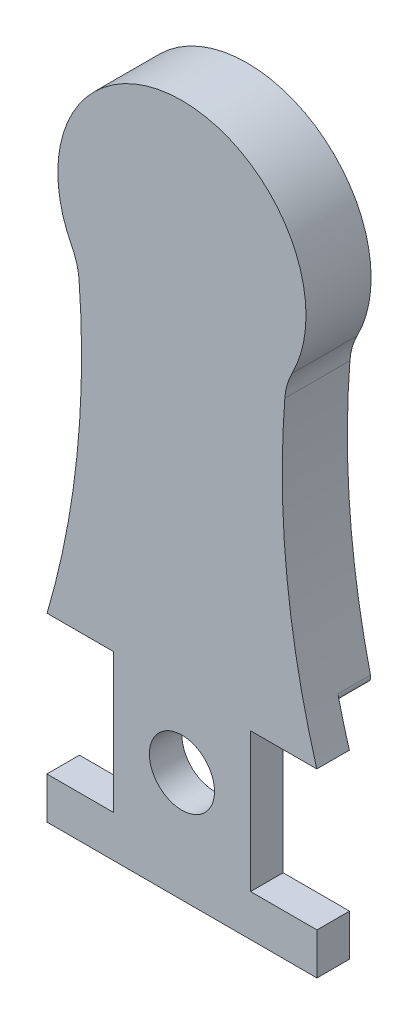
ISO-10303-21;
HEADER;
FILE_DESCRIPTION(('STEP AP214'),'2;1');
FILE_NAME('part.step','',(''),(''),'','','');
FILE_SCHEMA(('AUTOMOTIVE_DESIGN { 1 0 10303 214 1 1 1 1 }'));
ENDSEC;
DATA;
#1=APPLICATION_CONTEXT('core data for automotive mechanical design processes');
#2=APPLICATION_PROTOCOL_DEFINITION('international standard','automotive_design',2000,#1);
#3=PRODUCT_CONTEXT('',#1,'mechanical');
#4=PRODUCT('Part','Part','',(#3));
#5=PRODUCT_RELATED_PRODUCT_CATEGORY('part','',(#4));
#6=PRODUCT_DEFINITION_FORMATION('','',#4);
#7=PRODUCT_DEFINITION_CONTEXT('part definition',#1,'design');
#8=PRODUCT_DEFINITION('design','',#6,#7);
#9=PRODUCT_DEFINITION_SHAPE('','',#8);
#10=(LENGTH_UNIT() NAMED_UNIT(*) SI_UNIT(.MILLI.,.METRE.));
#11=(NAMED_UNIT(*) PLANE_ANGLE_UNIT() SI_UNIT($,.RADIAN.));
#12=(NAMED_UNIT(*) SI_UNIT($,.STERADIAN.) SOLID_ANGLE_UNIT());
#13=UNCERTAINTY_MEASURE_WITH_UNIT(LENGTH_MEASURE(1.E-05),#10,'distance_accuracy_value','');
#14=(GEOMETRIC_REPRESENTATION_CONTEXT(3) GLOBAL_UNCERTAINTY_ASSIGNED_CONTEXT((#13)) GLOBAL_UNIT_ASSIGNED_CONTEXT((#10,
#11,#12)) REPRESENTATION_CONTEXT('',''));
#15=CARTESIAN_POINT('',(0.,0.,0.));
#16=DIRECTION('',(0.,0.,1.));
#17=DIRECTION('',(1.,0.,0.));
#18=AXIS2_PLACEMENT_3D('',#15,#16,#17);
#19=CARTESIAN_POINT('',(0.,0.,0.));
#20=DIRECTION('',(0.,0.,1.));
#21=DIRECTION('',(1.,0.,0.));
#22=AXIS2_PLACEMENT_3D('',#19,#20,#21);
#23=CYLINDRICAL_SURFACE('',#22,5.);
#24=CARTESIAN_POINT('',(0.,0.,10.));
#25=DIRECTION('',(0.,0.,1.));
#26=DIRECTION('',(1.,0.,0.));
#27=AXIS2_PLACEMENT_3D('',#24,#25,#26);
#28=CIRCLE('',#27,5.);
#29=CARTESIAN_POINT('',(5.,0.,10.));
#30=VERTEX_POINT('',#29);
#31=EDGE_CURVE('E195',#30,#30,#28,.T.);
#32=ORIENTED_EDGE('',*,*,#31,.T.);
#33=EDGE_LOOP('',(#32));
#34=FACE_BOUND('',#33,.T.);
#35=CARTESIAN_POINT('',(0.,0.,5.));
#36=DIRECTION('',(0.,0.,-1.));
#37=DIRECTION('',(-1.,0.,0.));
#38=AXIS2_PLACEMENT_3D('',#35,#36,#37);
#39=CIRCLE('',#38,5.);
#40=CARTESIAN_POINT('',(-5.,0.,5.));
#41=VERTEX_POINT('',#40);
#42=EDGE_CURVE('E260',#41,#41,#39,.F.);
#43=ORIENTED_EDGE('',*,*,#42,.F.);
#44=EDGE_LOOP('',(#43));
#45=FACE_BOUND('',#44,.T.);
#46=ADVANCED_FACE('F33',(#34,#45),#23,.F.);
#47=CARTESIAN_POINT('',(-20.9931970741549,10.845815,0.));
#48=DIRECTION('',(0.,1.,0.));
#49=DIRECTION('',(0.,0.,1.));
#50=AXIS2_PLACEMENT_3D('',#47,#48,#49);
#51=PLANE('',#50);
#52=DIRECTION('',(-1.,0.,0.));
#53=VECTOR('',#52,1.);
#54=CARTESIAN_POINT('',(-20.9931970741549,10.845815,5.));
#55=LINE('',#54,#53);
#56=CARTESIAN_POINT('',(-10.542895,10.845815,5.));
#57=VERTEX_POINT('',#56);
#58=CARTESIAN_POINT('',(-20.7164128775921,10.845815,5.));
#59=VERTEX_POINT('',#58);
#60=EDGE_CURVE('E261',#57,#59,#55,.T.);
#61=ORIENTED_EDGE('',*,*,#60,.F.);
#62=DIRECTION('',(0.,0.,1.));
#63=VECTOR('',#62,1.);
#64=CARTESIAN_POINT('',(-10.542895,10.845815,0.));
#65=LINE('',#64,#63);
#66=CARTESIAN_POINT('',(-10.542895,10.845815,10.));
#67=VERTEX_POINT('',#66);
#68=EDGE_CURVE('E192',#57,#67,#65,.T.);
#69=ORIENTED_EDGE('',*,*,#68,.T.);
#70=DIRECTION('',(-1.,0.,0.));
#71=VECTOR('',#70,1.);
#72=CARTESIAN_POINT('',(-20.9931970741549,10.845815,10.));
#73=LINE('',#72,#71);
#74=CARTESIAN_POINT('',(-20.7164128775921,10.845815,10.));
#75=VERTEX_POINT('',#74);
#76=EDGE_CURVE('E184',#67,#75,#73,.T.);
#77=ORIENTED_EDGE('',*,*,#76,.T.);
#78=DIRECTION('',(0.,0.,-1.));
#79=VECTOR('',#78,1.);
#80=CARTESIAN_POINT('',(-20.7164128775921,10.845815,10.));
#81=LINE('',#80,#79);
#82=EDGE_CURVE('E191',#59,#75,#81,.F.);
#83=ORIENTED_EDGE('',*,*,#82,.F.);
#84=EDGE_LOOP('',(#61,#69,#77,#83));
#85=FACE_BOUND('',#84,.T.);
#86=ADVANCED_FACE('F335',(#85),#51,.F.);
#87=CARTESIAN_POINT('',(10.542895,10.845815,0.));
#88=DIRECTION('',(0.,1.,0.));
#89=DIRECTION('',(-1.,0.,0.));
#90=AXIS2_PLACEMENT_3D('',#87,#88,#89);
#91=PLANE('',#90);
#92=DIRECTION('',(-1.,0.,0.));
#93=VECTOR('',#92,1.);
#94=CARTESIAN_POINT('',(10.542895,10.845815,5.));
#95=LINE('',#94,#93);
#96=CARTESIAN_POINT('',(20.7164128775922,10.845815,5.));
#97=VERTEX_POINT('',#96);
#98=CARTESIAN_POINT('',(10.542895,10.845815,5.));
#99=VERTEX_POINT('',#98);
#100=EDGE_CURVE('E162',#97,#99,#95,.T.);
#101=ORIENTED_EDGE('',*,*,#100,.F.);
#102=DIRECTION('',(0.,0.,-1.));
#103=VECTOR('',#102,1.);
#104=CARTESIAN_POINT('',(20.7164128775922,10.845815,10.));
#105=LINE('',#104,#103);
#106=CARTESIAN_POINT('',(20.7164128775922,10.845815,10.));
#107=VERTEX_POINT('',#106);
#108=EDGE_CURVE('E188',#107,#97,#105,.T.);
#109=ORIENTED_EDGE('',*,*,#108,.F.);
#110=DIRECTION('',(-1.,0.,0.));
#111=VECTOR('',#110,1.);
#112=CARTESIAN_POINT('',(10.542895,10.845815,10.));
#113=LINE('',#112,#111);
#114=CARTESIAN_POINT('',(10.542895,10.845815,10.));
#115=VERTEX_POINT('',#114);
#116=EDGE_CURVE('E274',#107,#115,#113,.T.);
#117=ORIENTED_EDGE('',*,*,#116,.T.);
#118=DIRECTION('',(0.,0.,1.));
#119=VECTOR('',#118,1.);
#120=CARTESIAN_POINT('',(10.542895,10.845815,0.));
#121=LINE('',#120,#119);
#122=EDGE_CURVE('E180',#99,#115,#121,.T.);
#123=ORIENTED_EDGE('',*,*,#122,.F.);
#124=EDGE_LOOP('',(#101,#109,#117,#123));
#125=FACE_BOUND('',#124,.T.);
#126=ADVANCED_FACE('F362',(#125),#91,.F.);
#127=CARTESIAN_POINT('',(-10.542895,10.845815,0.));
#128=DIRECTION('',(1.,0.,0.));
#129=DIRECTION('',(0.,1.,0.));
#130=AXIS2_PLACEMENT_3D('',#127,#128,#129);
#131=PLANE('',#130);
#132=DIRECTION('',(0.,1.,0.));
#133=VECTOR('',#132,1.);
#134=CARTESIAN_POINT('',(-10.542895,10.845815,5.));
#135=LINE('',#134,#133);
#136=CARTESIAN_POINT('',(-10.542895,-10.5428949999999,5.));
#137=VERTEX_POINT('',#136);
#138=EDGE_CURVE('E266',#137,#57,#135,.T.);
#139=ORIENTED_EDGE('',*,*,#138,.F.);
#140=DIRECTION('',(0.,0.,1.));
#141=VECTOR('',#140,1.);
#142=CARTESIAN_POINT('',(-10.542895,-10.5428949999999,0.));
#143=LINE('',#142,#141);
#144=CARTESIAN_POINT('',(-10.542895,-10.5428949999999,10.));
#145=VERTEX_POINT('',#144);
#146=EDGE_CURVE('E298',#137,#145,#143,.T.);
#147=ORIENTED_EDGE('',*,*,#146,.T.);
#148=DIRECTION('',(0.,1.,0.));
#149=VECTOR('',#148,1.);
#150=CARTESIAN_POINT('',(-10.542895,10.845815,10.));
#151=LINE('',#150,#149);
#152=EDGE_CURVE('E292',#145,#67,#151,.T.);
#153=ORIENTED_EDGE('',*,*,#152,.T.);
#154=ORIENTED_EDGE('',*,*,#68,.F.);
#155=EDGE_LOOP('',(#139,#147,#153,#154));
#156=FACE_BOUND('',#155,.T.);
#157=ADVANCED_FACE('F336',(#156),#131,.F.);
#158=CARTESIAN_POINT('',(-10.542895,-10.5428949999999,0.));
#159=DIRECTION('',(0.,-1.,0.));
#160=DIRECTION('',(0.,0.,-1.));
#161=AXIS2_PLACEMENT_3D('',#158,#159,#160);
#162=PLANE('',#161);
#163=DIRECTION('',(1.,0.,0.));
#164=VECTOR('',#163,1.);
#165=CARTESIAN_POINT('',(-10.542895,-10.5428949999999,5.));
#166=LINE('',#165,#164);
#167=CARTESIAN_POINT('',(-20.741205,-10.5428949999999,5.));
#168=VERTEX_POINT('',#167);
#169=EDGE_CURVE('E324',#168,#137,#166,.T.);
#170=ORIENTED_EDGE('',*,*,#169,.F.);
#171=DIRECTION('',(0.,0.,1.));
#172=VECTOR('',#171,1.);
#173=CARTESIAN_POINT('',(-20.741205,-10.5428949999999,0.));
#174=LINE('',#173,#172);
#175=CARTESIAN_POINT('',(-20.741205,-10.5428949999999,10.));
#176=VERTEX_POINT('',#175);
#177=EDGE_CURVE('E300',#168,#176,#174,.T.);
#178=ORIENTED_EDGE('',*,*,#177,.T.);
#179=DIRECTION('',(1.,0.,0.));
#180=VECTOR('',#179,1.);
#181=CARTESIAN_POINT('',(-10.542895,-10.5428949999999,10.));
#182=LINE('',#181,#180);
#183=EDGE_CURVE('E289',#176,#145,#182,.T.);
#184=ORIENTED_EDGE('',*,*,#183,.T.);
#185=ORIENTED_EDGE('',*,*,#146,.F.);
#186=EDGE_LOOP('',(#170,#178,#184,#185));
#187=FACE_BOUND('',#186,.T.);
#188=ADVANCED_FACE('F371',(#187),#162,.F.);
#189=CARTESIAN_POINT('',(-20.741205,-10.5428949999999,0.));
#190=DIRECTION('',(1.,0.,0.));
#191=DIRECTION('',(0.,1.,0.));
#192=AXIS2_PLACEMENT_3D('',#189,#190,#191);
#193=PLANE('',#192);
#194=DIRECTION('',(0.,1.,0.));
#195=VECTOR('',#194,1.);
#196=CARTESIAN_POINT('',(-20.741205,-10.5428949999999,5.));
#197=LINE('',#196,#195);
#198=CARTESIAN_POINT('',(-20.741205,-16.942445,5.));
#199=VERTEX_POINT('',#198);
#200=EDGE_CURVE('E322',#199,#168,#197,.T.);
#201=ORIENTED_EDGE('',*,*,#200,.F.);
#202=DIRECTION('',(0.,0.,1.));
#203=VECTOR('',#202,1.);
#204=CARTESIAN_POINT('',(-20.741205,-16.942445,0.));
#205=LINE('',#204,#203);
#206=CARTESIAN_POINT('',(-20.741205,-16.942445,10.));
#207=VERTEX_POINT('',#206);
#208=EDGE_CURVE('E302',#199,#207,#205,.T.);
#209=ORIENTED_EDGE('',*,*,#208,.T.);
#210=DIRECTION('',(0.,1.,0.));
#211=VECTOR('',#210,1.);
#212=CARTESIAN_POINT('',(-20.741205,-10.5428949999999,10.));
#213=LINE('',#212,#211);
#214=EDGE_CURVE('E286',#207,#176,#213,.T.);
#215=ORIENTED_EDGE('',*,*,#214,.T.);
#216=ORIENTED_EDGE('',*,*,#177,.F.);
#217=EDGE_LOOP('',(#201,#209,#215,#216));
#218=FACE_BOUND('',#217,.T.);
#219=ADVANCED_FACE('F321',(#218),#193,.F.);
#220=CARTESIAN_POINT('',(-20.741205,-16.942445,0.));
#221=DIRECTION('',(0.,1.,0.));
#222=DIRECTION('',(-1.,0.,0.));
#223=AXIS2_PLACEMENT_3D('',#220,#221,#222);
#224=PLANE('',#223);
#225=DIRECTION('',(-1.,0.,0.));
#226=VECTOR('',#225,1.);
#227=CARTESIAN_POINT('',(-20.741205,-16.942445,5.));
#228=LINE('',#227,#226);
#229=CARTESIAN_POINT('',(20.741205,-16.9424449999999,5.));
#230=VERTEX_POINT('',#229);
#231=EDGE_CURVE('E310',#230,#199,#228,.T.);
#232=ORIENTED_EDGE('',*,*,#231,.F.);
#233=DIRECTION('',(0.,0.,1.));
#234=VECTOR('',#233,1.);
#235=CARTESIAN_POINT('',(20.741205,-16.9424449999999,0.));
#236=LINE('',#235,#234);
#237=CARTESIAN_POINT('',(20.741205,-16.9424449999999,10.));
#238=VERTEX_POINT('',#237);
#239=EDGE_CURVE('E182',#230,#238,#236,.T.);
#240=ORIENTED_EDGE('',*,*,#239,.T.);
#241=DIRECTION('',(-1.,0.,0.));
#242=VECTOR('',#241,1.);
#243=CARTESIAN_POINT('',(-20.741205,-16.942445,10.));
#244=LINE('',#243,#242);
#245=EDGE_CURVE('E283',#238,#207,#244,.T.);
#246=ORIENTED_EDGE('',*,*,#245,.T.);
#247=ORIENTED_EDGE('',*,*,#208,.F.);
#248=EDGE_LOOP('',(#232,#240,#246,#247));
#249=FACE_BOUND('',#248,.T.);
#250=ADVANCED_FACE('F306',(#249),#224,.F.);
#251=CARTESIAN_POINT('',(20.741205,-16.9424449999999,0.));
#252=DIRECTION('',(-1.,0.,0.));
#253=DIRECTION('',(0.,-1.,0.));
#254=AXIS2_PLACEMENT_3D('',#251,#252,#253);
#255=PLANE('',#254);
#256=DIRECTION('',(0.,-1.,0.));
#257=VECTOR('',#256,1.);
#258=CARTESIAN_POINT('',(20.741205,-16.9424449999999,5.));
#259=LINE('',#258,#257);
#260=CARTESIAN_POINT('',(20.741205,-10.5428949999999,5.));
#261=VERTEX_POINT('',#260);
#262=EDGE_CURVE('E174',#261,#230,#259,.T.);
#263=ORIENTED_EDGE('',*,*,#262,.F.);
#264=DIRECTION('',(0.,0.,1.));
#265=VECTOR('',#264,1.);
#266=CARTESIAN_POINT('',(20.741205,-10.5428949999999,0.));
#267=LINE('',#266,#265);
#268=CARTESIAN_POINT('',(20.741205,-10.5428949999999,10.));
#269=VERTEX_POINT('',#268);
#270=EDGE_CURVE('E173',#261,#269,#267,.T.);
#271=ORIENTED_EDGE('',*,*,#270,.T.);
#272=DIRECTION('',(0.,-1.,0.));
#273=VECTOR('',#272,1.);
#274=CARTESIAN_POINT('',(20.741205,-16.9424449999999,10.));
#275=LINE('',#274,#273);
#276=EDGE_CURVE('E280',#269,#238,#275,.T.);
#277=ORIENTED_EDGE('',*,*,#276,.T.);
#278=ORIENTED_EDGE('',*,*,#239,.F.);
#279=EDGE_LOOP('',(#263,#271,#277,#278));
#280=FACE_BOUND('',#279,.T.);
#281=ADVANCED_FACE('F313',(#280),#255,.F.);
#282=CARTESIAN_POINT('',(20.741205,-10.5428949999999,0.));
#283=DIRECTION('',(0.,-1.,0.));
#284=DIRECTION('',(0.,0.,-1.));
#285=AXIS2_PLACEMENT_3D('',#282,#283,#284);
#286=PLANE('',#285);
#287=DIRECTION('',(1.,0.,0.));
#288=VECTOR('',#287,1.);
#289=CARTESIAN_POINT('',(20.741205,-10.5428949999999,5.));
#290=LINE('',#289,#288);
#291=CARTESIAN_POINT('',(10.542895,-10.5428949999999,5.));
#292=VERTEX_POINT('',#291);
#293=EDGE_CURVE('E159',#292,#261,#290,.T.);
#294=ORIENTED_EDGE('',*,*,#293,.F.);
#295=DIRECTION('',(0.,0.,1.));
#296=VECTOR('',#295,1.);
#297=CARTESIAN_POINT('',(10.542895,-10.5428949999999,0.));
#298=LINE('',#297,#296);
#299=CARTESIAN_POINT('',(10.542895,-10.5428949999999,10.));
#300=VERTEX_POINT('',#299);
#301=EDGE_CURVE('E171',#292,#300,#298,.T.);
#302=ORIENTED_EDGE('',*,*,#301,.T.);
#303=DIRECTION('',(1.,0.,0.));
#304=VECTOR('',#303,1.);
#305=CARTESIAN_POINT('',(20.741205,-10.5428949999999,10.));
#306=LINE('',#305,#304);
#307=EDGE_CURVE('E278',#300,#269,#306,.T.);
#308=ORIENTED_EDGE('',*,*,#307,.T.);
#309=ORIENTED_EDGE('',*,*,#270,.F.);
#310=EDGE_LOOP('',(#294,#302,#308,#309));
#311=FACE_BOUND('',#310,.T.);
#312=ADVANCED_FACE('F169',(#311),#286,.F.);
#313=CARTESIAN_POINT('',(10.542895,-10.5428949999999,0.));
#314=DIRECTION('',(-1.,0.,0.));
#315=DIRECTION('',(0.,-1.,0.));
#316=AXIS2_PLACEMENT_3D('',#313,#314,#315);
#317=PLANE('',#316);
#318=DIRECTION('',(0.,-1.,0.));
#319=VECTOR('',#318,1.);
#320=CARTESIAN_POINT('',(10.542895,-10.5428949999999,5.));
#321=LINE('',#320,#319);
#322=EDGE_CURVE('E156',#99,#292,#321,.T.);
#323=ORIENTED_EDGE('',*,*,#322,.F.);
#324=ORIENTED_EDGE('',*,*,#122,.T.);
#325=DIRECTION('',(0.,-1.,0.));
#326=VECTOR('',#325,1.);
#327=CARTESIAN_POINT('',(10.542895,-10.5428949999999,10.));
#328=LINE('',#327,#326);
#329=EDGE_CURVE('E178',#115,#300,#328,.T.);
#330=ORIENTED_EDGE('',*,*,#329,.T.);
#331=ORIENTED_EDGE('',*,*,#301,.F.);
#332=EDGE_LOOP('',(#323,#324,#330,#331));
#333=FACE_BOUND('',#332,.T.);
#334=ADVANCED_FACE('F176',(#333),#317,.F.);
#335=CARTESIAN_POINT('',(0.,70.3553754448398,10.));
#336=DIRECTION('',(0.,0.,-1.));
#337=DIRECTION('',(-1.,0.,0.));
#338=AXIS2_PLACEMENT_3D('',#335,#336,#337);
#339=CYLINDRICAL_SURFACE('',#338,19.0586935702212);
#340=CARTESIAN_POINT('',(0.,70.3553754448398,0.));
#341=DIRECTION('',(0.,0.,1.));
#342=DIRECTION('',(-1.,0.,0.));
#343=AXIS2_PLACEMENT_3D('',#340,#341,#342);
#344=CIRCLE('',#343,19.0586935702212);
#345=CARTESIAN_POINT('',(16.9028870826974,61.5504785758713,0.));
#346=VERTEX_POINT('',#345);
#347=CARTESIAN_POINT('',(-16.9028870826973,61.5504785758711,0.));
#348=VERTEX_POINT('',#347);
#349=EDGE_CURVE('E198',#346,#348,#344,.T.);
#350=ORIENTED_EDGE('',*,*,#349,.T.);
#351=DIRECTION('',(0.,0.,-1.));
#352=VECTOR('',#351,1.);
#353=CARTESIAN_POINT('',(-16.9028870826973,61.5504785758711,10.));
#354=LINE('',#353,#352);
#355=CARTESIAN_POINT('',(-16.9028870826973,61.5504785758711,10.));
#356=VERTEX_POINT('',#355);
#357=EDGE_CURVE('E226',#348,#356,#354,.F.);
#358=ORIENTED_EDGE('',*,*,#357,.T.);
#359=CARTESIAN_POINT('',(0.,70.3553754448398,10.));
#360=DIRECTION('',(0.,0.,1.));
#361=DIRECTION('',(-1.,0.,0.));
#362=AXIS2_PLACEMENT_3D('',#359,#360,#361);
#363=CIRCLE('',#362,19.0586935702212);
#364=CARTESIAN_POINT('',(16.9028870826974,61.5504785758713,10.));
#365=VERTEX_POINT('',#364);
#366=EDGE_CURVE('E199',#365,#356,#363,.T.);
#367=ORIENTED_EDGE('',*,*,#366,.F.);
#368=DIRECTION('',(0.,0.,-1.));
#369=VECTOR('',#368,1.);
#370=CARTESIAN_POINT('',(16.9028870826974,61.5504785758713,10.));
#371=LINE('',#370,#369);
#372=EDGE_CURVE('E208',#365,#346,#371,.T.);
#373=ORIENTED_EDGE('',*,*,#372,.T.);
#374=EDGE_LOOP('',(#350,#358,#367,#373));
#375=FACE_BOUND('',#374,.T.);
#376=ADVANCED_FACE('F347',(#375),#339,.T.);
#377=CARTESIAN_POINT('',(-145.699843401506,47.6415158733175,10.));
#378=DIRECTION('',(0.,0.,-1.));
#379=DIRECTION('',(-1.,0.,0.));
#380=AXIS2_PLACEMENT_3D('',#377,#378,#379);
#381=CYLINDRICAL_SURFACE('',#380,130.287303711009);
#382=CARTESIAN_POINT('',(-145.699843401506,47.6415158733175,0.));
#383=DIRECTION('',(0.,0.,-1.));
#384=DIRECTION('',(1.,0.,0.));
#385=AXIS2_PLACEMENT_3D('',#382,#383,#384);
#386=CIRCLE('',#385,130.287303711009);
#387=CARTESIAN_POINT('',(-15.8016087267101,57.7028347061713,0.));
#388=VERTEX_POINT('',#387);
#389=CARTESIAN_POINT('',(-18.9585956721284,17.4514904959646,0.));
#390=VERTEX_POINT('',#389);
#391=EDGE_CURVE('E211',#388,#390,#386,.T.);
#392=ORIENTED_EDGE('',*,*,#391,.T.);
#393=DIRECTION('',(0.,0.,-1.));
#394=VECTOR('',#393,1.);
#395=CARTESIAN_POINT('',(-18.9585956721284,17.4514904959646,10.));
#396=LINE('',#395,#394);
#397=CARTESIAN_POINT('',(-18.9585956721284,17.4514904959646,5.));
#398=VERTEX_POINT('',#397);
#399=EDGE_CURVE('E41',#390,#398,#396,.F.);
#400=ORIENTED_EDGE('',*,*,#399,.T.);
#401=CARTESIAN_POINT('',(-145.699843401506,47.6415158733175,5.));
#402=DIRECTION('',(0.,0.,-1.));
#403=DIRECTION('',(-1.,0.,0.));
#404=AXIS2_PLACEMENT_3D('',#401,#402,#403);
#405=CIRCLE('',#404,130.287303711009);
#406=EDGE_CURVE('E47',#59,#398,#405,.F.);
#407=ORIENTED_EDGE('',*,*,#406,.F.);
#408=ORIENTED_EDGE('',*,*,#82,.T.);
#409=CARTESIAN_POINT('',(-145.699843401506,47.6415158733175,10.));
#410=DIRECTION('',(0.,0.,-1.));
#411=DIRECTION('',(1.,0.,0.));
#412=AXIS2_PLACEMENT_3D('',#409,#410,#411);
#413=CIRCLE('',#412,130.287303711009);
#414=CARTESIAN_POINT('',(-15.8016087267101,57.7028347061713,10.));
#415=VERTEX_POINT('',#414);
#416=EDGE_CURVE('E202',#415,#75,#413,.T.);
#417=ORIENTED_EDGE('',*,*,#416,.F.);
#418=DIRECTION('',(0.,0.,-1.));
#419=VECTOR('',#418,1.);
#420=CARTESIAN_POINT('',(-15.8016087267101,57.7028347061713,10.));
#421=LINE('',#420,#419);
#422=EDGE_CURVE('E223',#415,#388,#421,.T.);
#423=ORIENTED_EDGE('',*,*,#422,.T.);
#424=EDGE_LOOP('',(#392,#400,#407,#408,#417,#423));
#425=FACE_BOUND('',#424,.T.);
#426=ADVANCED_FACE('F250',(#425),#381,.F.);
#427=CARTESIAN_POINT('',(145.699843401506,47.6415158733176,10.));
#428=DIRECTION('',(0.,0.,-1.));
#429=DIRECTION('',(-1.,0.,0.));
#430=AXIS2_PLACEMENT_3D('',#427,#428,#429);
#431=CYLINDRICAL_SURFACE('',#430,130.287303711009);
#432=CARTESIAN_POINT('',(145.699843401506,47.6415158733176,5.));
#433=DIRECTION('',(0.,0.,-1.));
#434=DIRECTION('',(-1.,0.,0.));
#435=AXIS2_PLACEMENT_3D('',#432,#433,#434);
#436=CIRCLE('',#435,130.287303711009);
#437=CARTESIAN_POINT('',(18.9585956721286,17.4514904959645,5.));
#438=VERTEX_POINT('',#437);
#439=EDGE_CURVE('E264',#438,#97,#436,.F.);
#440=ORIENTED_EDGE('',*,*,#439,.F.);
#441=DIRECTION('',(0.,0.,-1.));
#442=VECTOR('',#441,1.);
#443=CARTESIAN_POINT('',(18.9585956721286,17.4514904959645,10.));
#444=LINE('',#443,#442);
#445=CARTESIAN_POINT('',(18.9585956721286,17.4514904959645,0.));
#446=VERTEX_POINT('',#445);
#447=EDGE_CURVE('E232',#438,#446,#444,.T.);
#448=ORIENTED_EDGE('',*,*,#447,.T.);
#449=CARTESIAN_POINT('',(145.699843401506,47.6415158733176,0.));
#450=DIRECTION('',(0.,0.,-1.));
#451=DIRECTION('',(-1.,0.,0.));
#452=AXIS2_PLACEMENT_3D('',#449,#450,#451);
#453=CIRCLE('',#452,130.287303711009);
#454=CARTESIAN_POINT('',(15.8016087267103,57.7028347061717,0.));
#455=VERTEX_POINT('',#454);
#456=EDGE_CURVE('E203',#446,#455,#453,.T.);
#457=ORIENTED_EDGE('',*,*,#456,.T.);
#458=DIRECTION('',(0.,0.,-1.));
#459=VECTOR('',#458,1.);
#460=CARTESIAN_POINT('',(15.8016087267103,57.7028347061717,10.));
#461=LINE('',#460,#459);
#462=CARTESIAN_POINT('',(15.8016087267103,57.7028347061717,10.));
#463=VERTEX_POINT('',#462);
#464=EDGE_CURVE('E216',#455,#463,#461,.F.);
#465=ORIENTED_EDGE('',*,*,#464,.T.);
#466=CARTESIAN_POINT('',(145.699843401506,47.6415158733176,10.));
#467=DIRECTION('',(0.,0.,-1.));
#468=DIRECTION('',(-1.,0.,0.));
#469=AXIS2_PLACEMENT_3D('',#466,#467,#468);
#470=CIRCLE('',#469,130.287303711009);
#471=EDGE_CURVE('E205',#107,#463,#470,.T.);
#472=ORIENTED_EDGE('',*,*,#471,.F.);
#473=ORIENTED_EDGE('',*,*,#108,.T.);
#474=EDGE_LOOP('',(#440,#448,#457,#465,#472,#473));
#475=FACE_BOUND('',#474,.T.);
#476=ADVANCED_FACE('F356',(#475),#431,.F.);
#477=CARTESIAN_POINT('',(72.8499217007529,58.9984456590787,10.));
#478=DIRECTION('',(0.,0.,-1.));
#479=DIRECTION('',(-1.,0.,0.));
#480=AXIS2_PLACEMENT_3D('',#477,#478,#479);
#481=PLANE('',#480);
#482=ORIENTED_EDGE('',*,*,#31,.F.);
#483=EDGE_LOOP('',(#482));
#484=FACE_BOUND('',#483,.T.);
#485=ORIENTED_EDGE('',*,*,#366,.T.);
#486=CARTESIAN_POINT('',(-25.771746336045,56.9305937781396,10.));
#487=DIRECTION('',(0.,0.,-1.));
#488=DIRECTION('',(-1.,0.,0.));
#489=AXIS2_PLACEMENT_3D('',#486,#487,#488);
#490=CIRCLE('',#489,10.);
#491=EDGE_CURVE('E230',#356,#415,#490,.T.);
#492=ORIENTED_EDGE('',*,*,#491,.T.);
#493=ORIENTED_EDGE('',*,*,#416,.T.);
#494=ORIENTED_EDGE('',*,*,#76,.F.);
#495=ORIENTED_EDGE('',*,*,#152,.F.);
#496=ORIENTED_EDGE('',*,*,#183,.F.);
#497=ORIENTED_EDGE('',*,*,#214,.F.);
#498=ORIENTED_EDGE('',*,*,#245,.F.);
#499=ORIENTED_EDGE('',*,*,#276,.F.);
#500=ORIENTED_EDGE('',*,*,#307,.F.);
#501=ORIENTED_EDGE('',*,*,#329,.F.);
#502=ORIENTED_EDGE('',*,*,#116,.F.);
#503=ORIENTED_EDGE('',*,*,#471,.T.);
#504=CARTESIAN_POINT('',(25.7717463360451,56.93059377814,10.));
#505=DIRECTION('',(0.,0.,-1.));
#506=DIRECTION('',(-1.,0.,0.));
#507=AXIS2_PLACEMENT_3D('',#504,#505,#506);
#508=CIRCLE('',#507,10.);
#509=EDGE_CURVE('E221',#463,#365,#508,.T.);
#510=ORIENTED_EDGE('',*,*,#509,.T.);
#511=EDGE_LOOP('',(#485,#492,#493,#494,#495,#496,#497,#498,#499,#500,#501,#502,#503,#510));
#512=FACE_BOUND('',#511,.T.);
#513=ADVANCED_FACE('F315',(#484,#512),#481,.F.);
#514=CARTESIAN_POINT('',(72.8499217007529,58.9984456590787,0.));
#515=DIRECTION('',(0.,0.,-1.));
#516=DIRECTION('',(-1.,0.,0.));
#517=AXIS2_PLACEMENT_3D('',#514,#515,#516);
#518=PLANE('',#517);
#519=CARTESIAN_POINT('',(0.,0.,0.));
#520=DIRECTION('',(0.,0.,-1.));
#521=DIRECTION('',(1.,0.,0.));
#522=AXIS2_PLACEMENT_3D('',#519,#520,#521);
#523=CIRCLE('',#522,23.9);
#524=CARTESIAN_POINT('',(-17.2634910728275,16.5282145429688,0.));
#525=VERTEX_POINT('',#524);
#526=CARTESIAN_POINT('',(17.2634910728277,16.5282145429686,0.));
#527=VERTEX_POINT('',#526);
#528=EDGE_CURVE('E270',#525,#527,#523,.T.);
#529=ORIENTED_EDGE('',*,*,#528,.F.);
#530=CARTESIAN_POINT('',(-17.9858128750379,17.2197716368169,0.));
#531=DIRECTION('',(0.,0.,-1.));
#532=DIRECTION('',(-1.,0.,0.));
#533=AXIS2_PLACEMENT_3D('',#530,#531,#532);
#534=CIRCLE('',#533,1.);
#535=EDGE_CURVE('E55',#525,#390,#534,.T.);
#536=ORIENTED_EDGE('',*,*,#535,.T.);
#537=ORIENTED_EDGE('',*,*,#391,.F.);
#538=CARTESIAN_POINT('',(-25.771746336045,56.9305937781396,0.));
#539=DIRECTION('',(0.,0.,-1.));
#540=DIRECTION('',(-1.,0.,0.));
#541=AXIS2_PLACEMENT_3D('',#538,#539,#540);
#542=CIRCLE('',#541,10.);
#543=EDGE_CURVE('E228',#388,#348,#542,.F.);
#544=ORIENTED_EDGE('',*,*,#543,.T.);
#545=ORIENTED_EDGE('',*,*,#349,.F.);
#546=CARTESIAN_POINT('',(25.7717463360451,56.93059377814,0.));
#547=DIRECTION('',(0.,0.,-1.));
#548=DIRECTION('',(-1.,0.,0.));
#549=AXIS2_PLACEMENT_3D('',#546,#547,#548);
#550=CIRCLE('',#549,10.);
#551=EDGE_CURVE('E218',#346,#455,#550,.F.);
#552=ORIENTED_EDGE('',*,*,#551,.T.);
#553=ORIENTED_EDGE('',*,*,#456,.F.);
#554=CARTESIAN_POINT('',(17.9858128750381,17.2197716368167,0.));
#555=DIRECTION('',(0.,0.,-1.));
#556=DIRECTION('',(-1.,0.,0.));
#557=AXIS2_PLACEMENT_3D('',#554,#555,#556);
#558=CIRCLE('',#557,1.);
#559=EDGE_CURVE('E235',#446,#527,#558,.T.);
#560=ORIENTED_EDGE('',*,*,#559,.T.);
#561=EDGE_LOOP('',(#529,#536,#537,#544,#545,#552,#553,#560));
#562=FACE_BOUND('',#561,.T.);
#563=ADVANCED_FACE('F345',(#562),#518,.T.);
#564=CARTESIAN_POINT('',(171.891549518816,75.7576069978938,5.));
#565=DIRECTION('',(0.,0.,-1.));
#566=DIRECTION('',(-1.,0.,0.));
#567=AXIS2_PLACEMENT_3D('',#564,#565,#566);
#568=PLANE('',#567);
#569=ORIENTED_EDGE('',*,*,#42,.T.);
#570=EDGE_LOOP('',(#569));
#571=FACE_BOUND('',#570,.T.);
#572=ORIENTED_EDGE('',*,*,#406,.T.);
#573=CARTESIAN_POINT('',(-17.9858128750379,17.2197716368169,5.));
#574=DIRECTION('',(0.,0.,-1.));
#575=DIRECTION('',(-1.,0.,0.));
#576=AXIS2_PLACEMENT_3D('',#573,#574,#575);
#577=CIRCLE('',#576,1.);
#578=CARTESIAN_POINT('',(-17.2634910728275,16.5282145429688,5.));
#579=VERTEX_POINT('',#578);
#580=EDGE_CURVE('E11',#398,#579,#577,.F.);
#581=ORIENTED_EDGE('',*,*,#580,.T.);
#582=CARTESIAN_POINT('',(0.,0.,5.));
#583=DIRECTION('',(0.,0.,-1.));
#584=DIRECTION('',(1.,0.,0.));
#585=AXIS2_PLACEMENT_3D('',#582,#583,#584);
#586=CIRCLE('',#585,23.9);
#587=CARTESIAN_POINT('',(17.2634910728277,16.5282145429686,5.));
#588=VERTEX_POINT('',#587);
#589=EDGE_CURVE('E255',#579,#588,#586,.T.);
#590=ORIENTED_EDGE('',*,*,#589,.T.);
#591=CARTESIAN_POINT('',(17.9858128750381,17.2197716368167,5.));
#592=DIRECTION('',(0.,0.,-1.));
#593=DIRECTION('',(-1.,0.,0.));
#594=AXIS2_PLACEMENT_3D('',#591,#592,#593);
#595=CIRCLE('',#594,1.);
#596=EDGE_CURVE('E241',#588,#438,#595,.F.);
#597=ORIENTED_EDGE('',*,*,#596,.T.);
#598=ORIENTED_EDGE('',*,*,#439,.T.);
#599=ORIENTED_EDGE('',*,*,#100,.T.);
#600=ORIENTED_EDGE('',*,*,#322,.T.);
#601=ORIENTED_EDGE('',*,*,#293,.T.);
#602=ORIENTED_EDGE('',*,*,#262,.T.);
#603=ORIENTED_EDGE('',*,*,#231,.T.);
#604=ORIENTED_EDGE('',*,*,#200,.T.);
#605=ORIENTED_EDGE('',*,*,#169,.T.);
#606=ORIENTED_EDGE('',*,*,#138,.T.);
#607=ORIENTED_EDGE('',*,*,#60,.T.);
#608=EDGE_LOOP('',(#572,#581,#590,#597,#598,#599,#600,#601,#602,#603,#604,#605,#606,#607));
#609=FACE_BOUND('',#608,.T.);
#610=ADVANCED_FACE('F158',(#571,#609),#568,.T.);
#611=CARTESIAN_POINT('',(0.,0.,5.));
#612=DIRECTION('',(0.,0.,-1.));
#613=DIRECTION('',(-1.,0.,0.));
#614=AXIS2_PLACEMENT_3D('',#611,#612,#613);
#615=CYLINDRICAL_SURFACE('',#614,23.9);
#616=ORIENTED_EDGE('',*,*,#589,.F.);
#617=DIRECTION('',(0.,0.,-1.));
#618=VECTOR('',#617,1.);
#619=CARTESIAN_POINT('',(-17.2634910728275,16.5282145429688,5.));
#620=LINE('',#619,#618);
#621=EDGE_CURVE('E244',#579,#525,#620,.T.);
#622=ORIENTED_EDGE('',*,*,#621,.T.);
#623=ORIENTED_EDGE('',*,*,#528,.T.);
#624=DIRECTION('',(0.,0.,-1.));
#625=VECTOR('',#624,1.);
#626=CARTESIAN_POINT('',(17.2634910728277,16.5282145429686,5.));
#627=LINE('',#626,#625);
#628=EDGE_CURVE('E238',#527,#588,#627,.F.);
#629=ORIENTED_EDGE('',*,*,#628,.T.);
#630=EDGE_LOOP('',(#616,#622,#623,#629));
#631=FACE_BOUND('',#630,.T.);
#632=ADVANCED_FACE('F257',(#631),#615,.F.);
#633=CARTESIAN_POINT('',(25.7717463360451,56.93059377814,10.));
#634=DIRECTION('',(0.,0.,-1.));
#635=DIRECTION('',(-1.,0.,0.));
#636=AXIS2_PLACEMENT_3D('',#633,#634,#635);
#637=CYLINDRICAL_SURFACE('',#636,10.);
#638=ORIENTED_EDGE('',*,*,#509,.F.);
#639=ORIENTED_EDGE('',*,*,#464,.F.);
#640=ORIENTED_EDGE('',*,*,#551,.F.);
#641=ORIENTED_EDGE('',*,*,#372,.F.);
#642=EDGE_LOOP('',(#638,#639,#640,#641));
#643=FACE_BOUND('',#642,.T.);
#644=ADVANCED_FACE('F352',(#643),#637,.F.);
#645=CARTESIAN_POINT('',(-25.771746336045,56.9305937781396,10.));
#646=DIRECTION('',(0.,0.,-1.));
#647=DIRECTION('',(-1.,0.,0.));
#648=AXIS2_PLACEMENT_3D('',#645,#646,#647);
#649=CYLINDRICAL_SURFACE('',#648,10.);
#650=ORIENTED_EDGE('',*,*,#491,.F.);
#651=ORIENTED_EDGE('',*,*,#357,.F.);
#652=ORIENTED_EDGE('',*,*,#543,.F.);
#653=ORIENTED_EDGE('',*,*,#422,.F.);
#654=EDGE_LOOP('',(#650,#651,#652,#653));
#655=FACE_BOUND('',#654,.T.);
#656=ADVANCED_FACE('F342',(#655),#649,.F.);
#657=CARTESIAN_POINT('',(17.9858128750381,17.2197716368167,5.));
#658=DIRECTION('',(0.,0.,-1.));
#659=DIRECTION('',(-1.,0.,0.));
#660=AXIS2_PLACEMENT_3D('',#657,#658,#659);
#661=CYLINDRICAL_SURFACE('',#660,1.);
#662=ORIENTED_EDGE('',*,*,#596,.F.);
#663=ORIENTED_EDGE('',*,*,#628,.F.);
#664=ORIENTED_EDGE('',*,*,#559,.F.);
#665=ORIENTED_EDGE('',*,*,#447,.F.);
#666=EDGE_LOOP('',(#662,#663,#664,#665));
#667=FACE_BOUND('',#666,.T.);
#668=ADVANCED_FACE('F360',(#667),#661,.T.);
#669=CARTESIAN_POINT('',(-17.9858128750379,17.2197716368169,10.));
#670=DIRECTION('',(0.,0.,-1.));
#671=DIRECTION('',(-1.,0.,0.));
#672=AXIS2_PLACEMENT_3D('',#669,#670,#671);
#673=CYLINDRICAL_SURFACE('',#672,1.);
#674=ORIENTED_EDGE('',*,*,#580,.F.);
#675=ORIENTED_EDGE('',*,*,#399,.F.);
#676=ORIENTED_EDGE('',*,*,#535,.F.);
#677=ORIENTED_EDGE('',*,*,#621,.F.);
#678=EDGE_LOOP('',(#674,#675,#676,#677));
#679=FACE_BOUND('',#678,.T.);
#680=ADVANCED_FACE('F35',(#679),#673,.T.);
#681=CLOSED_SHELL('',(#46,#86,#126,#157,#188,#219,#250,#281,#312,#334,#376,#426,#476,#513,#563,
#610,#632,#644,#656,#668,#680));
#682=MANIFOLD_SOLID_BREP('B2',#681);
#683=ADVANCED_BREP_SHAPE_REPRESENTATION('',(#18,#682),#14);
#684=SHAPE_DEFINITION_REPRESENTATION(#9,#683);
ENDSEC;
END-ISO-10303-21;
